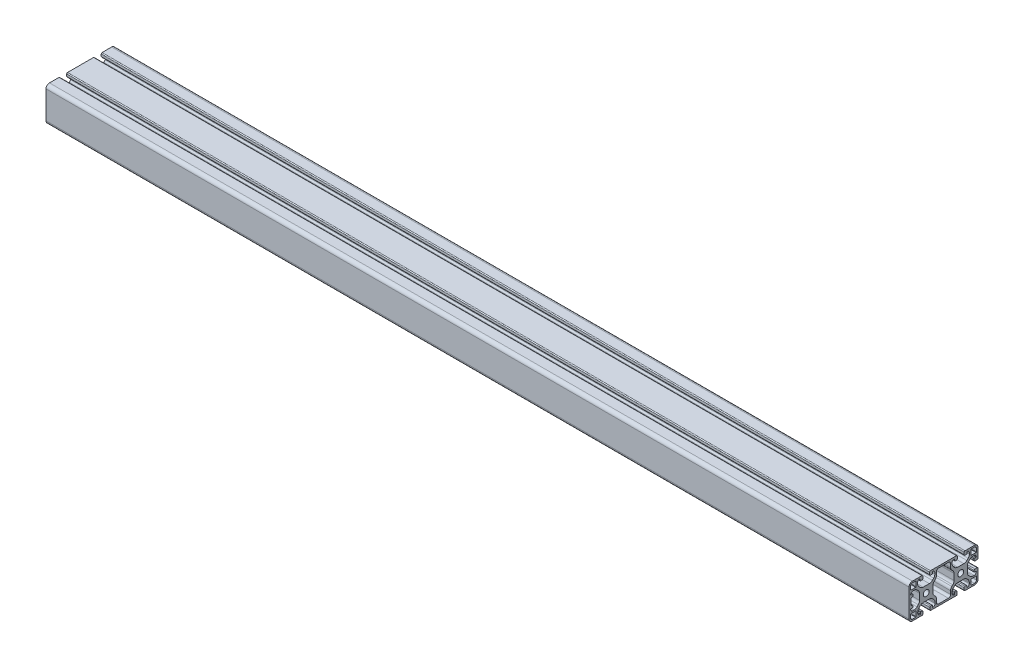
from build123d import *

# Parameters (mm, degrees)
SKIZZE11_R             = 3.399999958
STRUKTURBAUTEIL1_DEPTH = 1000


with BuildPart() as part:
    # Skizze11 → Strukturbauteil1 (new body)
    with BuildSketch(Plane(origin=(0, 0, 0), x_dir=(0, 0, -1), z_dir=(1, 0, 0))):
        with BuildLine():
            Line((-15.853896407, -17.61124977), (-15.853896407, -19.109999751))
            ThreePointArc((-15.853896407, -19.109999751), (-15.566227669, -19.712331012), (-14.963896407, -19.999999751))
            Line((-14.963896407, -19.999999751), (14.85264642, -19.999999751))
            ThreePointArc((14.85264642, -19.999999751), (15.454977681, -19.712331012), (15.74264642, -19.109999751))
            Line((15.74264642, -19.109999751), (15.74264642, -17.499999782))
            Line((15.74264642, -17.499999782), (15.74264642, -16.499999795))
            ThreePointArc((15.74264642, -16.499999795), (15.449753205, -15.792893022), (14.742646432, -15.499999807))
            Line((14.742646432, -15.499999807), (13.242646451, -15.499999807))
            ThreePointArc((13.242646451, -15.499999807), (12.889093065, -15.646446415), (12.742646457, -15.999999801))
            Line((12.742646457, -15.999999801), (12.742646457, -17.499999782))
            ThreePointArc((12.742646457, -17.499999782), (12.59619985, -17.853553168), (12.242646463, -17.999999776))
            ThreePointArc((12.242646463, -17.999999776), (10.474879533, -17.267766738), (9.742646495, -15.499999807))
            Line((9.742646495, -15.499999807), (9.742646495, -14.192387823))
            ThreePointArc((9.742646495, -14.192387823), (10.123248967, -12.278971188), (11.207112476, -10.656854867))
            Line((11.207112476, -10.656854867), (12.649499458, -9.214465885))
            ThreePointArc((12.649499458, -9.214465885), (14.271616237, -8.130602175), (16.185033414, -7.749999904))
            Line((16.185033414, -7.749999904), (23.300259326, -7.749999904))
            ThreePointArc((23.300259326, -7.749999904), (25.213676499, -8.130602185), (26.835793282, -9.214465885))
            Line((26.835793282, -9.214465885), (28.278184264, -10.656854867))
            ThreePointArc((28.278184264, -10.656854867), (29.362045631, -12.278971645), (29.742646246, -14.192387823))
            Line((29.742646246, -14.192387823), (29.742646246, -15.499999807))
            ThreePointArc((29.742646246, -15.499999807), (29.04459656, -17.227161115), (27.346004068, -17.99210758))
            ThreePointArc((27.346004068, -17.99210758), (26.992450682, -17.845660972), (26.846004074, -17.492107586))
            Line((26.846004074, -17.492107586), (26.846004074, -15.992107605))
            ThreePointArc((26.846004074, -15.992107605), (26.699557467, -15.638554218), (26.346004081, -15.492107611))
            Line((26.346004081, -15.492107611), (24.846004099, -15.492107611))
            ThreePointArc((24.846004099, -15.492107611), (24.138897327, -15.785000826), (23.846004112, -16.492107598))
            Line((23.846004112, -16.492107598), (23.846004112, -17.492107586))
            Line((23.846004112, -17.492107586), (23.846004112, -19.10917431))
            ThreePointArc((23.846004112, -19.10917431), (24.106920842, -19.73908302), (24.736829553, -19.999999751))
            Line((24.736829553, -19.999999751), (35.853896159, -19.999999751))
            ThreePointArc((35.853896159, -19.999999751), (38.682322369, -18.82842539), (39.853894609, -15.999998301))
            Line((39.853894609, -15.999998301), (39.853894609, -4.999998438))
            ThreePointArc((39.853894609, -4.999998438), (39.561001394, -4.292891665), (38.853894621, -3.99999845))
            Line((38.853894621, -3.99999845), (36.353894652, -3.99999845))
            ThreePointArc((36.353894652, -3.99999845), (35.64678788, -4.292891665), (35.353894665, -4.999998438))
            Line((35.353894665, -4.999998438), (35.353894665, -6.499998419))
            ThreePointArc((35.353894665, -6.499998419), (35.500341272, -6.853551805), (35.853894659, -6.999998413))
            Line((35.853894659, -6.999998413), (37.403897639, -6.999998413))
            ThreePointArc((37.403897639, -6.999998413), (37.722093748, -7.13180142), (37.853894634, -7.449998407))
            Line((37.853894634, -7.449998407), (37.853894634, -7.499998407))
            ThreePointArc((37.853894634, -7.499998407), (37.121661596, -9.267765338), (35.353894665, -9.999998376))
            Line((35.353894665, -9.999998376), (34.046284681, -9.999998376))
            ThreePointArc((34.046284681, -9.999998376), (32.132865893, -9.619396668), (30.510747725, -8.535532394))
            Line((30.510747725, -8.535532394), (29.068356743, -7.093143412))
            ThreePointArc((29.068356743, -7.093143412), (27.984495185, -5.471026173), (27.603894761, -3.557609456))
            Line((27.603894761, -3.557609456), (27.603894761, 3.557612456))
            ThreePointArc((27.603894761, 3.557612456), (27.98449889, 5.47103009), (29.068364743, 7.093146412))
            Line((29.068364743, 7.093146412), (30.510747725, 8.535535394))
            ThreePointArc((30.510747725, 8.535535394), (32.132865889, 9.619399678), (34.046284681, 10.000001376))
            Line((34.046284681, 10.000001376), (35.353894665, 10.000001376))
            ThreePointArc((35.353894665, 10.000001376), (37.121661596, 9.267768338), (37.853894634, 7.500001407))
            Line((37.853894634, 7.500001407), (37.853894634, 7.450002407))
            ThreePointArc((37.853894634, 7.450002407), (37.722094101, 7.131804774), (37.403897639, 7.000001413))
            Line((37.403897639, 7.000001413), (35.853894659, 7.000001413))
            ThreePointArc((35.853894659, 7.000001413), (35.500341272, 6.853554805), (35.353894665, 6.500001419))
            Line((35.353894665, 6.500001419), (35.353894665, 5.000001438))
            ThreePointArc((35.353894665, 5.000001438), (35.64678788, 4.292894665), (36.353894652, 4.00000145))
            Line((36.353894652, 4.00000145), (38.853894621, 4.00000145))
            ThreePointArc((38.853894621, 4.00000145), (39.560999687, 4.292893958), (39.853893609, 4.999998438))
            Line((39.853893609, 4.999998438), (39.853893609, 15.999998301))
            ThreePointArc((39.853893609, 15.999998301), (38.682321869, 18.828425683), (35.853895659, 20.000000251))
            Line((35.853895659, 20.000000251), (24.853895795, 20.000000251))
            ThreePointArc((24.853895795, 20.000000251), (24.146789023, 19.707107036), (23.853895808, 19.000000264))
            Line((23.853895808, 19.000000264), (23.853895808, 16.500000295))
            ThreePointArc((23.853895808, 16.500000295), (24.146789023, 15.792893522), (24.853895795, 15.500000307))
            Line((24.853895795, 15.500000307), (26.353895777, 15.500000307))
            ThreePointArc((26.353895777, 15.500000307), (26.707449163, 15.646446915), (26.853895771, 16.000000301))
            Line((26.853895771, 16.000000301), (26.853895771, 17.549999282))
            ThreePointArc((26.853895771, 17.549999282), (26.985696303, 17.868196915), (27.303892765, 18.000000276))
            Line((27.303892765, 18.000000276), (27.353895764, 18.000000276))
            ThreePointArc((27.353895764, 18.000000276), (29.121662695, 17.267767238), (29.853895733, 15.500000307))
            Line((29.853895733, 15.500000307), (29.853895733, 14.192387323))
            ThreePointArc((29.853895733, 14.192387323), (29.473294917, 12.278971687), (28.389433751, 10.656855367))
            Line((28.389433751, 10.656855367), (26.947042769, 9.214466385))
            ThreePointArc((26.947042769, 9.214466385), (25.324925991, 8.130602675), (23.411508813, 7.750000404))
            Line((23.411508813, 7.750000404), (16.296282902, 7.750000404))
            ThreePointArc((16.296282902, 7.750000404), (14.382865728, 8.130602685), (12.760748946, 9.214466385))
            Line((12.760748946, 9.214466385), (11.318361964, 10.656855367))
            ThreePointArc((11.318361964, 10.656855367), (10.234498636, 12.278971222), (9.853895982, 14.192387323))
            Line((9.853895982, 14.192387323), (9.853895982, 15.500000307))
            ThreePointArc((9.853895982, 15.500000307), (10.58612902, 17.267767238), (12.353895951, 18.000000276))
            Line((12.353895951, 18.000000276), (12.40389495, 18.000000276))
            ThreePointArc((12.40389495, 18.000000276), (12.722093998, 17.868198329), (12.853895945, 17.549999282))
            Line((12.853895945, 17.549999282), (12.853895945, 16.000000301))
            ThreePointArc((12.853895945, 16.000000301), (13.000342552, 15.646446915), (13.353895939, 15.500000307))
            Line((13.353895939, 15.500000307), (14.85389592, 15.500000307))
            ThreePointArc((14.85389592, 15.500000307), (15.561002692, 15.792893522), (15.853895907, 16.500000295))
            Line((15.853895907, 16.500000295), (15.853895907, 19.000000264))
            ThreePointArc((15.853895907, 19.000000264), (15.561002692, 19.707107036), (14.85389592, 20.000000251))
            Line((14.85389592, 20.000000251), (-15.146103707, 20.000000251))
            ThreePointArc((-15.146103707, 20.000000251), (-15.853210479, 19.707107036), (-16.146103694, 19.000000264))
            Line((-16.146103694, 19.000000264), (-16.146103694, 16.500000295))
            ThreePointArc((-16.146103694, 16.500000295), (-15.853210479, 15.792893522), (-15.146103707, 15.500000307))
            Line((-15.146103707, 15.500000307), (-13.646103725, 15.500000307))
            ThreePointArc((-13.646103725, 15.500000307), (-13.292550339, 15.646446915), (-13.146103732, 16.000000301))
            Line((-13.146103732, 16.000000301), (-13.146103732, 17.549999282))
            ThreePointArc((-13.146103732, 17.549999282), (-13.014301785, 17.868198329), (-12.696102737, 18.000000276))
            Line((-12.696102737, 18.000000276), (-12.646103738, 18.000000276))
            ThreePointArc((-12.646103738, 18.000000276), (-10.878336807, 17.267767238), (-10.146103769, 15.500000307))
            Line((-10.146103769, 15.500000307), (-10.146103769, 14.192387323))
            ThreePointArc((-10.146103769, 14.192387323), (-10.526706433, 12.278971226), (-11.610569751, 10.656855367))
            Line((-11.610569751, 10.656855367), (-13.052958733, 9.214466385))
            ThreePointArc((-13.052958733, 9.214466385), (-14.675075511, 8.130602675), (-16.588492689, 7.750000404))
            Line((-16.588492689, 7.750000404), (-23.7037146, 7.750000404))
            ThreePointArc((-23.7037146, 7.750000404), (-25.617131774, 8.130602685), (-27.239248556, 9.214466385))
            Line((-27.239248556, 9.214466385), (-28.681637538, 10.656855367))
            ThreePointArc((-28.681637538, 10.656855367), (-29.765500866, 12.278971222), (-30.14610352, 14.192387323))
            Line((-30.14610352, 14.192387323), (-30.14610352, 15.500000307))
            ThreePointArc((-30.14610352, 15.500000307), (-29.413870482, 17.267767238), (-27.646103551, 18.000000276))
            Line((-27.646103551, 18.000000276), (-27.596103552, 18.000000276))
            ThreePointArc((-27.596103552, 18.000000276), (-27.277905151, 17.868197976), (-27.146103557, 17.549999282))
            Line((-27.146103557, 17.549999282), (-27.146103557, 16.000000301))
            ThreePointArc((-27.146103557, 16.000000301), (-26.99965695, 15.646446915), (-26.646103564, 15.500000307))
            Line((-26.646103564, 15.500000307), (-25.146103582, 15.500000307))
            ThreePointArc((-25.146103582, 15.500000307), (-24.43899681, 15.792893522), (-24.146103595, 16.500000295))
            Line((-24.146103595, 16.500000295), (-24.146103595, 19.000000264))
            ThreePointArc((-24.146103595, 19.000000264), (-24.43899681, 19.707107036), (-25.146103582, 20.000000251))
            Line((-25.146103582, 20.000000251), (-36.146103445, 20.000000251))
            ThreePointArc((-36.146103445, 20.000000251), (-38.974530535, 18.828427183), (-40.146102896, 15.999999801))
            Line((-40.146102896, 15.999999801), (-40.146102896, -15.999999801))
            ThreePointArc((-40.146102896, -15.999999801), (-38.974530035, -18.82842689), (-36.146102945, -19.999999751))
            Line((-36.146102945, -19.999999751), (-24.855146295, -19.999999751))
            ThreePointArc((-24.855146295, -19.999999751), (-24.252815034, -19.712331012), (-23.965146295, -19.109999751))
            Line((-23.965146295, -19.109999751), (-23.965146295, -17.499999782))
            Line((-23.965146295, -17.499999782), (-23.965146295, -16.499999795))
            ThreePointArc((-23.965146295, -16.499999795), (-24.258039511, -15.792893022), (-24.965146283, -15.499999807))
            Line((-24.965146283, -15.499999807), (-26.465146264, -15.499999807))
            ThreePointArc((-26.465146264, -15.499999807), (-26.818699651, -15.646446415), (-26.965146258, -15.999999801))
            Line((-26.965146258, -15.999999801), (-26.965146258, -17.499999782))
            ThreePointArc((-26.965146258, -17.499999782), (-27.111592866, -17.853553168), (-27.465146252, -17.999999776))
            ThreePointArc((-27.465146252, -17.999999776), (-29.232913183, -17.267766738), (-29.965146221, -15.499999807))
            Line((-29.965146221, -15.499999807), (-29.965146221, -14.192387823))
            ThreePointArc((-29.965146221, -14.192387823), (-29.584543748, -12.278971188), (-28.500680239, -10.656854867))
            Line((-28.500680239, -10.656854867), (-27.058291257, -9.214465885))
            ThreePointArc((-27.058291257, -9.214465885), (-25.436174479, -8.130602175), (-23.522757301, -7.749999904))
            Line((-23.522757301, -7.749999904), (-16.407535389, -7.749999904))
            ThreePointArc((-16.407535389, -7.749999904), (-14.494118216, -8.130602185), (-12.872001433, -9.214465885))
            Line((-12.872001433, -9.214465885), (-11.429612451, -10.656854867))
            ThreePointArc((-11.429612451, -10.656854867), (-10.345748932, -12.278971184), (-9.96514647, -14.192387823))
            Line((-9.96514647, -14.192387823), (-9.96514647, -15.499999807))
            ThreePointArc((-9.96514647, -15.499999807), (-10.617956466, -17.301043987), (-12.353896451, -18.111249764))
            ThreePointArc((-12.353896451, -18.111249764), (-12.707449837, -17.964803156), (-12.853896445, -17.61124977))
            Line((-12.853896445, -17.61124977), (-12.853896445, -16.111249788))
            ThreePointArc((-12.853896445, -16.111249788), (-13.000343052, -15.757696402), (-13.353896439, -15.611249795))
            Line((-13.353896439, -15.611249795), (-14.85389642, -15.611249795))
            ThreePointArc((-14.85389642, -15.611249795), (-15.561003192, -15.90414301), (-15.853896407, -16.611249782))
            Line((-15.853896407, -16.611249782), (-15.853896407, -17.61124977))
        make_face()
        with Locations((-20.146103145, 0)):
            Circle(SKIZZE11_R, mode=Mode.SUBTRACT)
        with Locations((19.853896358, 0)):
            Circle(SKIZZE11_R, mode=Mode.SUBTRACT)
        with BuildLine():
            Line((9.518363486, -8.214212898), (10.639430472, -7.093144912))
            ThreePointArc((10.639430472, -7.093144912), (11.723294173, -5.471028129), (12.103896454, -3.557610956))
            Line((12.103896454, -3.557610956), (12.103896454, 3.557610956))
            ThreePointArc((12.103896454, 3.557610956), (11.723294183, 5.471028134), (10.639430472, 7.093144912))
            Line((10.639430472, 7.093144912), (9.518363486, 8.214213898))
            ThreePointArc((9.518363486, 8.214213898), (8.434499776, 9.836330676), (8.053897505, 11.749747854))
            Line((8.053897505, 11.749747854), (8.053897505, 15.499999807))
            ThreePointArc((8.053897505, 15.499999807), (7.321664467, 17.267766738), (5.553897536, 17.999999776))
            Line((5.553897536, 17.999999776), (-5.846104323, 17.999999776))
            ThreePointArc((-5.846104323, 17.999999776), (-7.613871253, 17.267766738), (-8.346104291, 15.499999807))
            Line((-8.346104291, 15.499999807), (-8.346104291, 11.749747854))
            ThreePointArc((-8.346104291, 11.749747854), (-8.726706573, 9.83633068), (-9.810570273, 8.214213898))
            Line((-9.810570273, 8.214213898), (-10.931637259, 7.093144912))
            ThreePointArc((-10.931637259, 7.093144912), (-12.01550096, 5.471028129), (-12.396103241, 3.557610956))
            Line((-12.396103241, 3.557610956), (-12.396103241, -3.557610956))
            ThreePointArc((-12.396103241, -3.557610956), (-12.01550097, -5.471028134), (-10.931637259, -7.093144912))
            Line((-10.931637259, -7.093144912), (-9.810570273, -8.214212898))
            ThreePointArc((-9.810570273, -8.214212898), (-8.726706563, -9.836329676), (-8.346104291, -11.749746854))
            Line((-8.346104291, -11.749746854), (-8.346104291, -15.499999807))
            ThreePointArc((-8.346104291, -15.499999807), (-7.613871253, -17.267766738), (-5.846104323, -17.999999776))
            Line((-5.846104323, -17.999999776), (5.553897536, -17.999999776))
            ThreePointArc((5.553897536, -17.999999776), (7.321664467, -17.267766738), (8.053897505, -15.499999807))
            Line((8.053897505, -15.499999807), (8.053897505, -11.749746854))
            ThreePointArc((8.053897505, -11.749746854), (8.434499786, -9.83632968), (9.518363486, -8.214212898))
        make_face(mode=Mode.SUBTRACT)
        with BuildLine():
            Line((-37.896102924, -3.504999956), (-37.896102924, 3.504999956))
            ThreePointArc((-37.896102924, 3.504999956), (-37.753884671, 3.802781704), (-37.456102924, 3.944999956))
            Line((-37.456102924, 3.944999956), (-36.646102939, 3.944999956))
            ThreePointArc((-36.646102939, 3.944999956), (-35.938996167, 4.237893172), (-35.646102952, 4.944999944))
            Line((-35.646102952, 4.944999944), (-35.646102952, 6.444999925))
            ThreePointArc((-35.646102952, 6.444999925), (-35.792549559, 6.798553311), (-36.146102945, 6.944999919))
            Line((-36.146102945, 6.944999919), (-37.696102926, 6.944999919))
            ThreePointArc((-37.696102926, 6.944999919), (-38.014301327, 7.076802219), (-38.146102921, 7.395000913))
            Line((-38.146102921, 7.395000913), (-38.146102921, 7.444999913))
            ThreePointArc((-38.146102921, 7.444999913), (-37.413869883, 9.212766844), (-35.646102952, 9.944999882))
            Line((-35.646102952, 9.944999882), (-34.338490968, 9.944999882))
            ThreePointArc((-34.338490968, 9.944999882), (-32.425074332, 9.564397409), (-30.802958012, 8.4805339))
            Line((-30.802958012, 8.4805339), (-29.36056903, 7.038144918))
            ThreePointArc((-29.36056903, 7.038144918), (-28.297383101, 5.466865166), (-27.896103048, 3.61261095))
            Line((-27.896103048, 3.61261095), (-27.896103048, -3.502610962))
            ThreePointArc((-27.896103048, -3.502610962), (-28.276705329, -5.416028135), (-29.36056903, -7.038144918))
            Line((-29.36056903, -7.038144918), (-30.802958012, -8.4805339))
            ThreePointArc((-30.802958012, -8.4805339), (-32.425074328, -9.564397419), (-34.338490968, -9.944999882))
            Line((-34.338490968, -9.944999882), (-35.646102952, -9.944999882))
            ThreePointArc((-35.646102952, -9.944999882), (-37.413869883, -9.212766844), (-38.146102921, -7.444999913))
            Line((-38.146102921, -7.444999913), (-38.146102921, -7.394999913))
            ThreePointArc((-38.146102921, -7.394999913), (-38.014300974, -7.076801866), (-37.696102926, -6.944999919))
            Line((-37.696102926, -6.944999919), (-36.146102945, -6.944999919))
            ThreePointArc((-36.146102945, -6.944999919), (-35.792549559, -6.798553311), (-35.646102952, -6.444999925))
            Line((-35.646102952, -6.444999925), (-35.646102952, -4.944999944))
            ThreePointArc((-35.646102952, -4.944999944), (-35.938996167, -4.237893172), (-36.646102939, -3.944999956))
            Line((-36.646102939, -3.944999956), (-37.456102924, -3.944999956))
            ThreePointArc((-37.456102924, -3.944999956), (-37.753884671, -3.802781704), (-37.896102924, -3.504999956))
        make_face(mode=Mode.SUBTRACT)
        with BuildLine():
            Line((37.553893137, -11.799998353), (32.153899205, -11.799998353))
            ThreePointArc((32.153899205, -11.799998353), (31.800345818, -11.946444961), (31.653899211, -12.299998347))
            Line((31.653899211, -12.299998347), (31.653899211, -17.69999828))
            ThreePointArc((31.653899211, -17.69999828), (31.800345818, -18.053551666), (32.153899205, -18.199998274))
            Line((32.153899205, -18.199998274), (35.853896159, -18.199998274))
            ThreePointArc((35.853896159, -18.199998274), (37.409529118, -17.555632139), (38.053893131, -15.999998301))
            Line((38.053893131, -15.999998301), (38.053893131, -12.299998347))
            ThreePointArc((38.053893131, -12.299998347), (37.907446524, -11.946444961), (37.553893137, -11.799998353))
        make_face(mode=Mode.SUBTRACT)
        with BuildLine():
            Line((-32.446102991, -11.799999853), (-37.846102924, -11.799999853))
            ThreePointArc((-37.846102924, -11.799999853), (-38.19965631, -11.946446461), (-38.346102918, -12.299999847))
            Line((-38.346102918, -12.299999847), (-38.346102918, -15.999999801))
            ThreePointArc((-38.346102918, -15.999999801), (-37.701737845, -17.5556347), (-36.146102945, -18.199999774))
            Line((-36.146102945, -18.199999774), (-32.446102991, -18.199999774))
            ThreePointArc((-32.446102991, -18.199999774), (-32.092549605, -18.053553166), (-31.946102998, -17.69999978))
            Line((-31.946102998, -17.69999978), (-31.946102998, -12.299999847))
            ThreePointArc((-31.946102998, -12.299999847), (-32.092549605, -11.946446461), (-32.446102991, -11.799999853))
        make_face(mode=Mode.SUBTRACT)
        with BuildLine():
            Line((-38.346103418, 15.999999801), (-38.346103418, 12.299998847))
            ThreePointArc((-38.346103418, 12.299998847), (-38.19965681, 11.946445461), (-37.846103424, 11.799998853))
            Line((-37.846103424, 11.799998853), (-32.446103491, 11.799998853))
            ThreePointArc((-32.446103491, 11.799998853), (-32.092550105, 11.946445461), (-31.946103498, 12.299998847))
            Line((-31.946103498, 12.299998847), (-31.946103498, 17.70000078))
            ThreePointArc((-31.946103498, 17.70000078), (-32.092550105, 18.053554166), (-32.446103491, 18.200000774))
            Line((-32.446103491, 18.200000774), (-36.146103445, 18.200000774))
            ThreePointArc((-36.146103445, 18.200000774), (-37.701738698, 17.555635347), (-38.346103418, 15.999999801))
        make_face(mode=Mode.SUBTRACT)
        with BuildLine():
            Line((31.653898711, 17.69999928), (31.653898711, 12.299997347))
            ThreePointArc((31.653898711, 12.299997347), (31.800345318, 11.946443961), (32.153898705, 11.799997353))
            Line((32.153898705, 11.799997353), (37.553892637, 11.799997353))
            ThreePointArc((37.553892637, 11.799997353), (37.907446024, 11.946443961), (38.053892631, 12.299997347))
            Line((38.053892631, 12.299997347), (38.053892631, 15.999998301))
            ThreePointArc((38.053892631, 15.999998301), (37.409528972, 17.555632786), (35.853895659, 18.199999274))
            Line((35.853895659, 18.199999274), (32.153898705, 18.199999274))
            ThreePointArc((32.153898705, 18.199999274), (31.800345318, 18.053552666), (31.653898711, 17.69999928))
        make_face(mode=Mode.SUBTRACT)
    extrude(amount=STRUKTURBAUTEIL1_DEPTH)


solid = part.part
